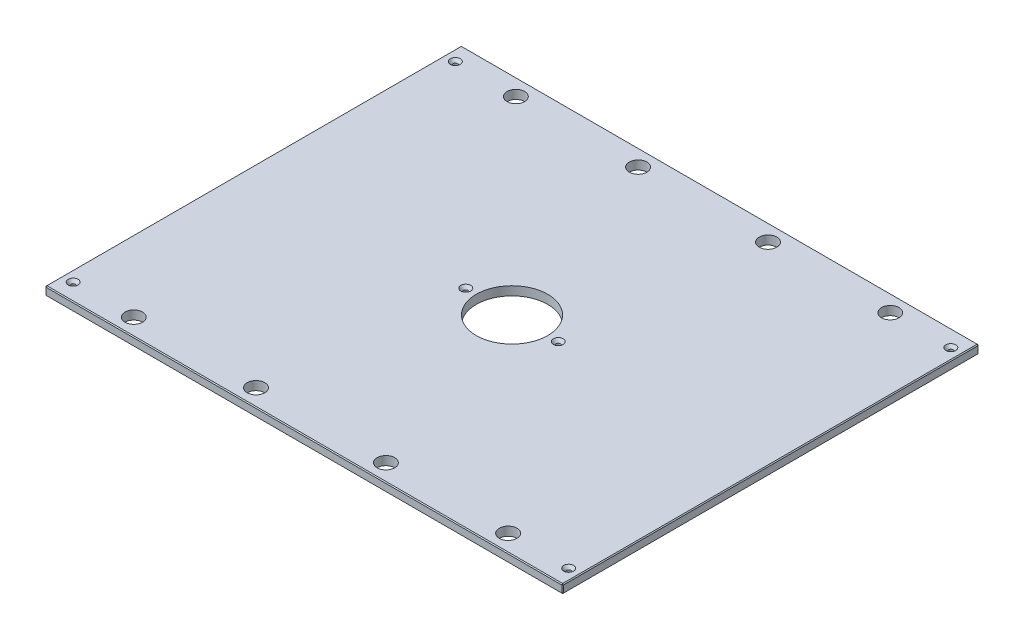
from build123d import *

# Parameters (mm, degrees)
SKETCH1_W                                        = 746.125
SKETCH1_H                                        = 600.075
BOSS_EXTRUDE1_DEPTH                              = 12.7
SKETCH13_R                                       = 51.562
CUT_EXTRUDE6_DEPTH                               = 479.914836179
F_1_1_DIAMETER_HOLE1_D                           = 25.4
CHAMFER2_SIZE                                    = 1.27
CSK_FOR_1_4_FLAT_HEAD_MACHINE_SCREW1_D           = 6.7564
CSK_FOR_1_4_FLAT_HEAD_MACHINE_SCREW1_CSINK_D     = 14.2748
CSK_FOR_1_4_FLAT_HEAD_MACHINE_SCREW1_CSINK_ANGLE = 82


with BuildPart() as part:
    # Sketch1 → Boss-Extrude1 (new body)
    with BuildSketch(Plane(origin=(0, 0, 0), x_dir=(1, 0, 0), z_dir=(0, 1, 0))):
        Rectangle(SKETCH1_W, SKETCH1_H)
    extrude(amount=BOSS_EXTRUDE1_DEPTH)

    # Sketch13 → Cut-Extrude6 (cut, through all)
    with BuildSketch(Plane(origin=(0, 12.7, 0), x_dir=(1, 0, 0), z_dir=(0, 1, 0))):
        with Locations(Location((0, 0, 0), (0, 0, 270))):
            Circle(SKETCH13_R)
    extrude(amount=-CUT_EXTRUDE6_DEPTH, mode=Mode.SUBTRACT)

    # 1 _1_ Diameter Hole1 (through all)
    with Locations(Plane(origin=(0, 12.7, 0), x_dir=(1, 0, 0), z_dir=(0, 1, 0))):
        with Locations((269.875, 275.42998), (-269.875, 275.42998), (269.875, -275.42998), (-269.875, -275.42998), (-93.6625, 275.42998), (93.6625, 275.42998), (93.6625, -275.42998), (-93.6625, -275.42998)):
            Hole(F_1_1_DIAMETER_HOLE1_D / 2)

    # Chamfer2
    chamfer2_edges = [part.edges().sort_by_distance(p)[0] for p in [
        (373.0625, 12.7, 0),
        (0, 12.7, -300.0375),
        (-373.0625, 12.7, 0),
        (0, 0, -300.0375),
        (373.0625, 0, 0),
        (0, 0, 300.0375),
        (-373.0625, 0, 0),
        (0, 12.7, 300.0375),
        (-373.0625, 6.35, -300.0375),
        (373.0625, 6.35, -300.0375),
        (373.0625, 6.35, 300.0375),
        (-373.0625, 6.35, 300.0375),
    ]]
    chamfer(chamfer2_edges, length=CHAMFER2_SIZE)

    # CSK for 1_4 Flat Head Machine Screw1 (through all)
    with Locations(Plane(origin=(0, 12.7, 0), x_dir=(1, 0, 0), z_dir=(0, 1, 0))):
        with Locations((357.1875, 275.42998), (357.1875, -275.42998), (-357.1875, -275.42998), (-66.675, 0), (66.675, 0), (-357.1875, 275.42998), (-269.875, 275.42998), (-269.875, -275.42998)):
            CounterSinkHole(CSK_FOR_1_4_FLAT_HEAD_MACHINE_SCREW1_D / 2, CSK_FOR_1_4_FLAT_HEAD_MACHINE_SCREW1_CSINK_D / 2, counter_sink_angle=CSK_FOR_1_4_FLAT_HEAD_MACHINE_SCREW1_CSINK_ANGLE)


solid = part.part
